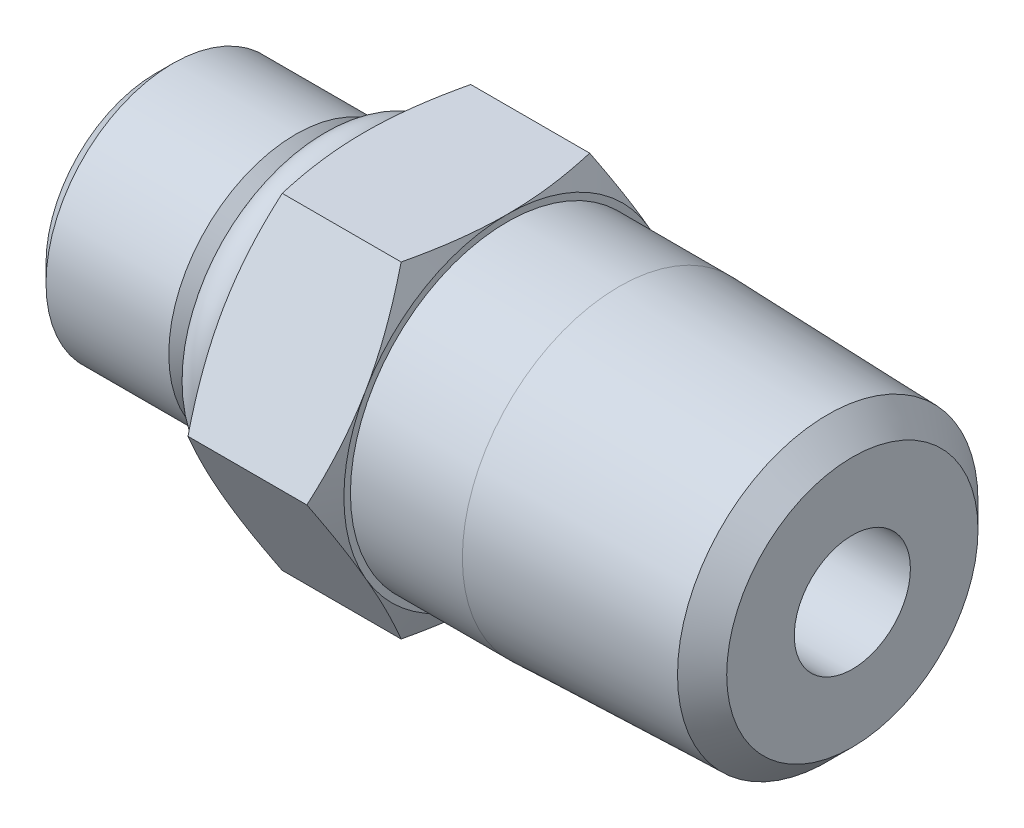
ISO-10303-21;
HEADER;
FILE_DESCRIPTION(('STEP AP214'),'2;1');
FILE_NAME('part.step','',(''),(''),'','','');
FILE_SCHEMA(('AUTOMOTIVE_DESIGN { 1 0 10303 214 1 1 1 1 }'));
ENDSEC;
DATA;
#1=APPLICATION_CONTEXT('core data for automotive mechanical design processes');
#2=APPLICATION_PROTOCOL_DEFINITION('international standard','automotive_design',2000,#1);
#3=PRODUCT_CONTEXT('',#1,'mechanical');
#4=PRODUCT('Part','Part','',(#3));
#5=PRODUCT_RELATED_PRODUCT_CATEGORY('part','',(#4));
#6=PRODUCT_DEFINITION_FORMATION('','',#4);
#7=PRODUCT_DEFINITION_CONTEXT('part definition',#1,'design');
#8=PRODUCT_DEFINITION('design','',#6,#7);
#9=PRODUCT_DEFINITION_SHAPE('','',#8);
#10=(LENGTH_UNIT() NAMED_UNIT(*) SI_UNIT(.MILLI.,.METRE.));
#11=(NAMED_UNIT(*) PLANE_ANGLE_UNIT() SI_UNIT($,.RADIAN.));
#12=(NAMED_UNIT(*) SI_UNIT($,.STERADIAN.) SOLID_ANGLE_UNIT());
#13=UNCERTAINTY_MEASURE_WITH_UNIT(LENGTH_MEASURE(1.E-05),#10,'distance_accuracy_value','');
#14=(GEOMETRIC_REPRESENTATION_CONTEXT(3) GLOBAL_UNCERTAINTY_ASSIGNED_CONTEXT((#13)) GLOBAL_UNIT_ASSIGNED_CONTEXT((#10,
#11,#12)) REPRESENTATION_CONTEXT('',''));
#15=CARTESIAN_POINT('',(0.,0.,0.));
#16=DIRECTION('',(0.,0.,1.));
#17=DIRECTION('',(1.,0.,0.));
#18=AXIS2_PLACEMENT_3D('',#15,#16,#17);
#19=CARTESIAN_POINT('',(8.128,0.,0.));
#20=DIRECTION('',(-1.,0.,0.));
#21=DIRECTION('',(0.,0.,1.));
#22=AXIS2_PLACEMENT_3D('',#19,#20,#21);
#23=TOROIDAL_SURFACE('',#22,5.5753,0.9906);
#24=ADVANCED_FACE('P0_F13',(),#23,.T.);
#25=CLOSED_SHELL('',(#24));
#26=MANIFOLD_SOLID_BREP('P0_B1',#25);
#27=CARTESIAN_POINT('',(9.144,0.,0.));
#28=DIRECTION('',(1.,0.,0.));
#29=DIRECTION('',(0.,0.,-1.));
#30=AXIS2_PLACEMENT_3D('',#27,#28,#29);
#31=CONICAL_SURFACE('',#30,7.14375,1.13446401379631);
#32=CARTESIAN_POINT('',(9.144,-3.571875,6.18666897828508));
#33=CARTESIAN_POINT('',(9.14397935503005,-3.722522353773,6.09969268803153));
#34=CARTESIAN_POINT('',(9.14696231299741,-3.87316545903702,6.01271885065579));
#35=CARTESIAN_POINT('',(9.15878262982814,-4.17426267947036,5.83888028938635));
#36=CARTESIAN_POINT('',(9.16761931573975,-4.32471681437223,5.75201555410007));
#37=CARTESIAN_POINT('',(9.19095547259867,-4.62479040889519,5.57876798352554));
#38=CARTESIAN_POINT('',(9.20543600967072,-4.77441098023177,5.49238450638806));
#39=CARTESIAN_POINT('',(9.2397794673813,-5.07318655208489,5.31988634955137));
#40=CARTESIAN_POINT('',(9.25964246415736,-5.22234154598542,5.23377167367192));
#41=CARTESIAN_POINT('',(9.32676799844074,-5.66870101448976,4.97606591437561));
#42=CARTESIAN_POINT('',(9.38158796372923,-5.96505481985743,4.80496596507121));
#43=CARTESIAN_POINT('',(9.50838008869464,-6.55605482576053,4.46375195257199));
#44=CARTESIAN_POINT('',(9.58040947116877,-6.85069189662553,4.29364316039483));
#45=CARTESIAN_POINT('',(9.65933616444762,-7.14375,4.12444598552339));
#46=B_SPLINE_CURVE_WITH_KNOTS('',3,(#32,#33,#34,#35,#36,#37,#38,#39,#40,#41,#42,#43,#44,#45),
.UNSPECIFIED.,.F.,.F.,(4,2,2,2,2,2,4),(0.,0.521824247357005,1.04358851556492,1.56361724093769,
2.08365332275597,3.12284200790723,4.1655353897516),.UNSPECIFIED.);
#47=CARTESIAN_POINT('',(9.144,-3.571875,6.18666897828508));
#48=VERTEX_POINT('',#47);
#49=CARTESIAN_POINT('',(9.65933616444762,-7.14375,4.12444598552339));
#50=VERTEX_POINT('',#49);
#51=EDGE_CURVE('P1_E223',#48,#50,#46,.T.);
#52=ORIENTED_EDGE('',*,*,#51,.F.);
#53=CARTESIAN_POINT('',(9.144,0.,0.));
#54=DIRECTION('',(1.,0.,0.));
#55=DIRECTION('',(0.,0.,-1.));
#56=AXIS2_PLACEMENT_3D('',#53,#54,#55);
#57=CIRCLE('',#56,7.14375);
#58=CARTESIAN_POINT('',(9.144,-7.14375,0.));
#59=VERTEX_POINT('',#58);
#60=EDGE_CURVE('P1_E229',#48,#59,#57,.T.);
#61=ORIENTED_EDGE('',*,*,#60,.T.);
#62=CARTESIAN_POINT('',(9.65933616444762,-7.14374999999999,4.12444598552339));
#63=CARTESIAN_POINT('',(9.58040947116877,-7.14374999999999,3.78605163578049));
#64=CARTESIAN_POINT('',(9.50838008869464,-7.14374999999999,3.44583405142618));
#65=CARTESIAN_POINT('',(9.38158796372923,-7.14374999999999,2.76340602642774));
#66=CARTESIAN_POINT('',(9.32676799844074,-7.14374999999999,2.42120612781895));
#67=CARTESIAN_POINT('',(9.25964246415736,-7.14374999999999,1.90579460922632));
#68=CARTESIAN_POINT('',(9.2397794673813,-7.14374999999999,1.73356525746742));
#69=CARTESIAN_POINT('',(9.20543600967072,-7.14374999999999,1.38856894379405));
#70=CARTESIAN_POINT('',(9.19095547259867,-7.14375,1.21580198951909));
#71=CARTESIAN_POINT('',(9.16761931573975,-7.14375,0.869306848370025));
#72=CARTESIAN_POINT('',(9.15878262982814,-7.14375,0.695577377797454));
#73=CARTESIAN_POINT('',(9.14696231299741,-7.14375,0.347900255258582));
#74=CARTESIAN_POINT('',(9.14397935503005,-7.14375,0.173952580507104));
#75=CARTESIAN_POINT('',(9.144,-7.14375,0.));
#76=B_SPLINE_CURVE_WITH_KNOTS('',3,(#62,#63,#64,#65,#66,#67,#68,#69,#70,#71,#72,#73,#74,#75),
.UNSPECIFIED.,.F.,.F.,(4,2,2,2,2,2,4),(0.,1.04269338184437,2.08188206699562,2.6019181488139,
3.12194687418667,3.64371114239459,4.16553538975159),.UNSPECIFIED.);
#77=EDGE_CURVE('P1_E115',#50,#59,#76,.T.);
#78=ORIENTED_EDGE('',*,*,#77,.F.);
#79=EDGE_LOOP('',(#52,#61,#78));
#80=FACE_BOUND('',#79,.T.);
#81=ADVANCED_FACE('P1_F16',(#80),#31,.T.);
#82=CARTESIAN_POINT('',(9.144,0.,0.));
#83=DIRECTION('',(1.,0.,0.));
#84=DIRECTION('',(0.,0.,-1.));
#85=AXIS2_PLACEMENT_3D('',#82,#83,#84);
#86=CONICAL_SURFACE('',#85,7.14375,1.13446401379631);
#87=CARTESIAN_POINT('',(9.144,-7.14375,0.));
#88=CARTESIAN_POINT('',(9.14397935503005,-7.14375,-0.1739525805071));
#89=CARTESIAN_POINT('',(9.14696231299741,-7.14375,-0.347900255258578));
#90=CARTESIAN_POINT('',(9.15878262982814,-7.14375,-0.695577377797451));
#91=CARTESIAN_POINT('',(9.16761931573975,-7.14375,-0.869306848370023));
#92=CARTESIAN_POINT('',(9.19095547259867,-7.14375,-1.21580198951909));
#93=CARTESIAN_POINT('',(9.20543600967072,-7.14375,-1.38856894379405));
#94=CARTESIAN_POINT('',(9.2397794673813,-7.14375,-1.73356525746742));
#95=CARTESIAN_POINT('',(9.25964246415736,-7.14375,-1.90579460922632));
#96=CARTESIAN_POINT('',(9.32676799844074,-7.14375,-2.42120612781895));
#97=CARTESIAN_POINT('',(9.38158796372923,-7.14375,-2.76340602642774));
#98=CARTESIAN_POINT('',(9.50838008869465,-7.14375,-3.44583405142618));
#99=CARTESIAN_POINT('',(9.58040947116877,-7.14375,-3.78605163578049));
#100=CARTESIAN_POINT('',(9.65933616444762,-7.14375,-4.12444598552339));
#101=B_SPLINE_CURVE_WITH_KNOTS('',3,(#87,#88,#89,#90,#91,#92,#93,#94,#95,#96,#97,#98,#99,#100),
.UNSPECIFIED.,.F.,.F.,(4,2,2,2,2,2,4),(0.,0.521824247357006,1.04358851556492,1.56361724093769,
2.08365332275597,3.12284200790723,4.1655353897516),.UNSPECIFIED.);
#102=CARTESIAN_POINT('',(9.65933616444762,-7.14375,-4.12444598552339));
#103=VERTEX_POINT('',#102);
#104=EDGE_CURVE('P1_E106',#59,#103,#101,.T.);
#105=ORIENTED_EDGE('',*,*,#104,.F.);
#106=CARTESIAN_POINT('',(9.144,0.,0.));
#107=DIRECTION('',(1.,0.,0.));
#108=DIRECTION('',(0.,0.,-1.));
#109=AXIS2_PLACEMENT_3D('',#106,#107,#108);
#110=CIRCLE('',#109,7.14375);
#111=CARTESIAN_POINT('',(9.144,-3.57187500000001,-6.18666897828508));
#112=VERTEX_POINT('',#111);
#113=EDGE_CURVE('P1_E123',#59,#112,#110,.T.);
#114=ORIENTED_EDGE('',*,*,#113,.T.);
#115=CARTESIAN_POINT('',(9.65933616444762,-7.14375,-4.12444598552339));
#116=CARTESIAN_POINT('',(9.58040947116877,-6.85069189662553,-4.29364316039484));
#117=CARTESIAN_POINT('',(9.50838008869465,-6.55605482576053,-4.46375195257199));
#118=CARTESIAN_POINT('',(9.38158796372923,-5.96505481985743,-4.80496596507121));
#119=CARTESIAN_POINT('',(9.32676799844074,-5.66870101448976,-4.97606591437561));
#120=CARTESIAN_POINT('',(9.25964246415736,-5.22234154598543,-5.23377167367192));
#121=CARTESIAN_POINT('',(9.2397794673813,-5.0731865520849,-5.31988634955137));
#122=CARTESIAN_POINT('',(9.20543600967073,-4.77441098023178,-5.49238450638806));
#123=CARTESIAN_POINT('',(9.19095547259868,-4.6247904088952,-5.57876798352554));
#124=CARTESIAN_POINT('',(9.16761931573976,-4.32471681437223,-5.75201555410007));
#125=CARTESIAN_POINT('',(9.15878262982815,-4.17426267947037,-5.83888028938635));
#126=CARTESIAN_POINT('',(9.14696231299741,-3.87316545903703,-6.01271885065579));
#127=CARTESIAN_POINT('',(9.14397935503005,-3.72252235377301,-6.09969268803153));
#128=CARTESIAN_POINT('',(9.144,-3.57187500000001,-6.18666897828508));
#129=B_SPLINE_CURVE_WITH_KNOTS('',3,(#115,#116,#117,#118,#119,#120,#121,#122,#123,#124,#125,
#126,#127,#128),.UNSPECIFIED.,.F.,.F.,(4,2,2,2,2,2,4),(0.,1.04269338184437,2.08188206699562,
2.6019181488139,3.12194687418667,3.64371114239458,4.16553538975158),.UNSPECIFIED.);
#130=EDGE_CURVE('P1_E20',#103,#112,#129,.T.);
#131=ORIENTED_EDGE('',*,*,#130,.F.);
#132=EDGE_LOOP('',(#105,#114,#131));
#133=FACE_BOUND('',#132,.T.);
#134=ADVANCED_FACE('P1_F121',(#133),#86,.T.);
#135=CARTESIAN_POINT('',(9.144,0.,0.));
#136=DIRECTION('',(1.,0.,0.));
#137=DIRECTION('',(0.,0.,-1.));
#138=AXIS2_PLACEMENT_3D('',#135,#136,#137);
#139=CONICAL_SURFACE('',#138,7.14375,1.13446401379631);
#140=CARTESIAN_POINT('',(9.144,0.,0.));
#141=DIRECTION('',(1.,0.,0.));
#142=DIRECTION('',(0.,0.,-1.));
#143=AXIS2_PLACEMENT_3D('',#140,#141,#142);
#144=CIRCLE('',#143,7.14375);
#145=CARTESIAN_POINT('',(9.144,3.571875,-6.18666897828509));
#146=VERTEX_POINT('',#145);
#147=EDGE_CURVE('P1_E366',#112,#146,#144,.T.);
#148=ORIENTED_EDGE('',*,*,#147,.T.);
#149=CARTESIAN_POINT('',(9.65933616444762,0.,-8.24889197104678));
#150=CARTESIAN_POINT('',(9.58040947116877,0.293058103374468,-8.07969479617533));
#151=CARTESIAN_POINT('',(9.50838008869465,0.587695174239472,-7.90958600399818));
#152=CARTESIAN_POINT('',(9.38158796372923,1.17869518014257,-7.56837199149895));
#153=CARTESIAN_POINT('',(9.32676799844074,1.47504898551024,-7.39727204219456));
#154=CARTESIAN_POINT('',(9.25964246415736,1.92140845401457,-7.13956628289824));
#155=CARTESIAN_POINT('',(9.2397794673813,2.0705634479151,-7.0534516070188));
#156=CARTESIAN_POINT('',(9.20543600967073,2.36933901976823,-6.88095345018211));
#157=CARTESIAN_POINT('',(9.19095547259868,2.51895959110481,-6.79456997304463));
#158=CARTESIAN_POINT('',(9.16761931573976,2.81903318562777,-6.6213224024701));
#159=CARTESIAN_POINT('',(9.15878262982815,2.96948732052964,-6.53445766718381));
#160=CARTESIAN_POINT('',(9.14696231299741,3.27058454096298,-6.36061910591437));
#161=CARTESIAN_POINT('',(9.14397935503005,3.42122764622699,-6.27364526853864));
#162=CARTESIAN_POINT('',(9.144,3.571875,-6.18666897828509));
#163=B_SPLINE_CURVE_WITH_KNOTS('',3,(#149,#150,#151,#152,#153,#154,#155,#156,#157,#158,#159,
#160,#161,#162),.UNSPECIFIED.,.F.,.F.,(4,2,2,2,2,2,4),(0.,1.04269338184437,2.08188206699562,
2.60191814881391,3.12194687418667,3.64371114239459,4.16553538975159),.UNSPECIFIED.);
#164=CARTESIAN_POINT('',(9.65933616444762,0.,-8.24889197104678));
#165=VERTEX_POINT('',#164);
#166=EDGE_CURVE('P1_E150',#165,#146,#163,.T.);
#167=ORIENTED_EDGE('',*,*,#166,.F.);
#168=CARTESIAN_POINT('',(9.144,-3.57187500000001,-6.18666897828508));
#169=CARTESIAN_POINT('',(9.14397935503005,-3.421227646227,-6.27364526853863));
#170=CARTESIAN_POINT('',(9.14696231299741,-3.27058454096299,-6.36061910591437));
#171=CARTESIAN_POINT('',(9.15878262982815,-2.96948732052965,-6.53445766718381));
#172=CARTESIAN_POINT('',(9.16761931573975,-2.81903318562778,-6.62132240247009));
#173=CARTESIAN_POINT('',(9.19095547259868,-2.51895959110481,-6.79456997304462));
#174=CARTESIAN_POINT('',(9.20543600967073,-2.36933901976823,-6.88095345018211));
#175=CARTESIAN_POINT('',(9.2397794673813,-2.07056344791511,-7.05345160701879));
#176=CARTESIAN_POINT('',(9.25964246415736,-1.92140845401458,-7.13956628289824));
#177=CARTESIAN_POINT('',(9.32676799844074,-1.47504898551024,-7.39727204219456));
#178=CARTESIAN_POINT('',(9.38158796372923,-1.17869518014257,-7.56837199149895));
#179=CARTESIAN_POINT('',(9.50838008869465,-0.587695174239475,-7.90958600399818));
#180=CARTESIAN_POINT('',(9.58040947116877,-0.29305810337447,-8.07969479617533));
#181=CARTESIAN_POINT('',(9.65933616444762,0.,-8.24889197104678));
#182=B_SPLINE_CURVE_WITH_KNOTS('',3,(#168,#169,#170,#171,#172,#173,#174,#175,#176,#177,#178,
#179,#180,#181),.UNSPECIFIED.,.F.,.F.,(4,2,2,2,2,2,4),(0.,0.521824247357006,1.04358851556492,
1.56361724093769,2.08365332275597,3.12284200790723,4.1655353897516),.UNSPECIFIED.);
#183=EDGE_CURVE('P1_E126',#112,#165,#182,.T.);
#184=ORIENTED_EDGE('',*,*,#183,.F.);
#185=EDGE_LOOP('',(#148,#167,#184));
#186=FACE_BOUND('',#185,.T.);
#187=ADVANCED_FACE('P1_F350',(#186),#139,.T.);
#188=CARTESIAN_POINT('',(9.144,0.,0.));
#189=DIRECTION('',(1.,0.,0.));
#190=DIRECTION('',(0.,0.,-1.));
#191=AXIS2_PLACEMENT_3D('',#188,#189,#190);
#192=CONICAL_SURFACE('',#191,7.14375,1.13446401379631);
#193=CARTESIAN_POINT('',(9.144,0.,0.));
#194=DIRECTION('',(1.,0.,0.));
#195=DIRECTION('',(0.,0.,-1.));
#196=AXIS2_PLACEMENT_3D('',#193,#194,#195);
#197=CIRCLE('',#196,7.14375);
#198=CARTESIAN_POINT('',(9.144,7.14375,0.));
#199=VERTEX_POINT('',#198);
#200=EDGE_CURVE('P1_E369',#146,#199,#197,.T.);
#201=ORIENTED_EDGE('',*,*,#200,.T.);
#202=CARTESIAN_POINT('',(9.65933616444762,7.14375,-4.12444598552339));
#203=CARTESIAN_POINT('',(9.58040947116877,7.14375,-3.78605163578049));
#204=CARTESIAN_POINT('',(9.50838008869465,7.14375,-3.44583405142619));
#205=CARTESIAN_POINT('',(9.38158796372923,7.14375,-2.76340602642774));
#206=CARTESIAN_POINT('',(9.32676799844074,7.14375,-2.42120612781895));
#207=CARTESIAN_POINT('',(9.25964246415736,7.14375,-1.90579460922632));
#208=CARTESIAN_POINT('',(9.2397794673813,7.14375,-1.73356525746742));
#209=CARTESIAN_POINT('',(9.20543600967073,7.14375,-1.38856894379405));
#210=CARTESIAN_POINT('',(9.19095547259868,7.14375,-1.21580198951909));
#211=CARTESIAN_POINT('',(9.16761931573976,7.14375,-0.869306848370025));
#212=CARTESIAN_POINT('',(9.15878262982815,7.14375,-0.695577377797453));
#213=CARTESIAN_POINT('',(9.14696231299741,7.14375,-0.34790025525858));
#214=CARTESIAN_POINT('',(9.14397935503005,7.14375,-0.173952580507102));
#215=CARTESIAN_POINT('',(9.144,7.14375,0.));
#216=B_SPLINE_CURVE_WITH_KNOTS('',3,(#202,#203,#204,#205,#206,#207,#208,#209,#210,#211,#212,
#213,#214,#215),.UNSPECIFIED.,.F.,.F.,(4,2,2,2,2,2,4),(0.,1.04269338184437,2.08188206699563,
2.60191814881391,3.12194687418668,3.64371114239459,4.1655353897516),.UNSPECIFIED.);
#217=CARTESIAN_POINT('',(9.65933616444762,7.14375,-4.1244459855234));
#218=VERTEX_POINT('',#217);
#219=EDGE_CURVE('P1_E146',#218,#199,#216,.T.);
#220=ORIENTED_EDGE('',*,*,#219,.F.);
#221=CARTESIAN_POINT('',(9.144,3.571875,-6.18666897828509));
#222=CARTESIAN_POINT('',(9.14397935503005,3.72252235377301,-6.09969268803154));
#223=CARTESIAN_POINT('',(9.14696231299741,3.87316545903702,-6.0127188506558));
#224=CARTESIAN_POINT('',(9.15878262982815,4.17426267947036,-5.83888028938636));
#225=CARTESIAN_POINT('',(9.16761931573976,4.32471681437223,-5.75201555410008));
#226=CARTESIAN_POINT('',(9.19095547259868,4.62479040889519,-5.57876798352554));
#227=CARTESIAN_POINT('',(9.20543600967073,4.77441098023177,-5.49238450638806));
#228=CARTESIAN_POINT('',(9.2397794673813,5.0731865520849,-5.31988634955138));
#229=CARTESIAN_POINT('',(9.25964246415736,5.22234154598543,-5.23377167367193));
#230=CARTESIAN_POINT('',(9.32676799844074,5.66870101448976,-4.97606591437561));
#231=CARTESIAN_POINT('',(9.38158796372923,5.96505481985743,-4.80496596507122));
#232=CARTESIAN_POINT('',(9.50838008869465,6.55605482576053,-4.463751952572));
#233=CARTESIAN_POINT('',(9.58040947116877,6.85069189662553,-4.29364316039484));
#234=CARTESIAN_POINT('',(9.65933616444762,7.14375,-4.1244459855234));
#235=B_SPLINE_CURVE_WITH_KNOTS('',3,(#221,#222,#223,#224,#225,#226,#227,#228,#229,#230,#231,
#232,#233,#234),.UNSPECIFIED.,.F.,.F.,(4,2,2,2,2,2,4),(0.,0.521824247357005,1.04358851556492,
1.56361724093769,2.08365332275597,3.12284200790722,4.16553538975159),.UNSPECIFIED.);
#236=EDGE_CURVE('P1_E147',#146,#218,#235,.T.);
#237=ORIENTED_EDGE('',*,*,#236,.F.);
#238=EDGE_LOOP('',(#201,#220,#237));
#239=FACE_BOUND('',#238,.T.);
#240=ADVANCED_FACE('P1_F347',(#239),#192,.T.);
#241=CARTESIAN_POINT('',(9.144,0.,0.));
#242=DIRECTION('',(1.,0.,0.));
#243=DIRECTION('',(0.,0.,-1.));
#244=AXIS2_PLACEMENT_3D('',#241,#242,#243);
#245=CONICAL_SURFACE('',#244,7.14375,1.13446401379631);
#246=CARTESIAN_POINT('',(9.144,0.,0.));
#247=DIRECTION('',(1.,0.,0.));
#248=DIRECTION('',(0.,0.,-1.));
#249=AXIS2_PLACEMENT_3D('',#246,#247,#248);
#250=CIRCLE('',#249,7.14375);
#251=CARTESIAN_POINT('',(9.144,3.571875,6.18666897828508));
#252=VERTEX_POINT('',#251);
#253=EDGE_CURVE('P1_E377',#199,#252,#250,.T.);
#254=ORIENTED_EDGE('',*,*,#253,.T.);
#255=CARTESIAN_POINT('',(9.65933616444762,7.14375,4.12444598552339));
#256=CARTESIAN_POINT('',(9.58040947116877,6.85069189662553,4.29364316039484));
#257=CARTESIAN_POINT('',(9.50838008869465,6.55605482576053,4.46375195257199));
#258=CARTESIAN_POINT('',(9.38158796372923,5.96505481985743,4.80496596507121));
#259=CARTESIAN_POINT('',(9.32676799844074,5.66870101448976,4.97606591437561));
#260=CARTESIAN_POINT('',(9.25964246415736,5.22234154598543,5.23377167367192));
#261=CARTESIAN_POINT('',(9.2397794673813,5.0731865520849,5.31988634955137));
#262=CARTESIAN_POINT('',(9.20543600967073,4.77441098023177,5.49238450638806));
#263=CARTESIAN_POINT('',(9.19095547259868,4.62479040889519,5.57876798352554));
#264=CARTESIAN_POINT('',(9.16761931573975,4.32471681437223,5.75201555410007));
#265=CARTESIAN_POINT('',(9.15878262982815,4.17426267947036,5.83888028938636));
#266=CARTESIAN_POINT('',(9.14696231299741,3.87316545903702,6.01271885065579));
#267=CARTESIAN_POINT('',(9.14397935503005,3.72252235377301,6.09969268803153));
#268=CARTESIAN_POINT('',(9.144,3.571875,6.18666897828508));
#269=B_SPLINE_CURVE_WITH_KNOTS('',3,(#255,#256,#257,#258,#259,#260,#261,#262,#263,#264,#265,
#266,#267,#268),.UNSPECIFIED.,.F.,.F.,(4,2,2,2,2,2,4),(0.,1.04269338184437,2.08188206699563,
2.60191814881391,3.12194687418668,3.64371114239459,4.1655353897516),.UNSPECIFIED.);
#270=CARTESIAN_POINT('',(9.65933616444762,7.14375,4.12444598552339));
#271=VERTEX_POINT('',#270);
#272=EDGE_CURVE('P1_E141',#271,#252,#269,.T.);
#273=ORIENTED_EDGE('',*,*,#272,.F.);
#274=CARTESIAN_POINT('',(9.144,7.14375,0.));
#275=CARTESIAN_POINT('',(9.14397935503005,7.14375,0.1739525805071));
#276=CARTESIAN_POINT('',(9.14696231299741,7.14375,0.347900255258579));
#277=CARTESIAN_POINT('',(9.15878262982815,7.14375,0.695577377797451));
#278=CARTESIAN_POINT('',(9.16761931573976,7.14375,0.869306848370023));
#279=CARTESIAN_POINT('',(9.19095547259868,7.14375,1.21580198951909));
#280=CARTESIAN_POINT('',(9.20543600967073,7.14375,1.38856894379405));
#281=CARTESIAN_POINT('',(9.2397794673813,7.14375,1.73356525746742));
#282=CARTESIAN_POINT('',(9.25964246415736,7.14375,1.90579460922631));
#283=CARTESIAN_POINT('',(9.32676799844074,7.14375,2.42120612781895));
#284=CARTESIAN_POINT('',(9.38158796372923,7.14375,2.76340602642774));
#285=CARTESIAN_POINT('',(9.50838008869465,7.14375,3.44583405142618));
#286=CARTESIAN_POINT('',(9.58040947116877,7.14375,3.78605163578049));
#287=CARTESIAN_POINT('',(9.65933616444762,7.14375,4.12444598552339));
#288=B_SPLINE_CURVE_WITH_KNOTS('',3,(#274,#275,#276,#277,#278,#279,#280,#281,#282,#283,#284,
#285,#286,#287),.UNSPECIFIED.,.F.,.F.,(4,2,2,2,2,2,4),(0.,0.521824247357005,1.04358851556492,
1.56361724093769,2.08365332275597,3.12284200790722,4.16553538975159),.UNSPECIFIED.);
#289=EDGE_CURVE('P1_E142',#199,#271,#288,.T.);
#290=ORIENTED_EDGE('',*,*,#289,.F.);
#291=EDGE_LOOP('',(#254,#273,#290));
#292=FACE_BOUND('',#291,.T.);
#293=ADVANCED_FACE('P1_F243',(#292),#245,.T.);
#294=CARTESIAN_POINT('',(9.144,0.,0.));
#295=DIRECTION('',(1.,0.,0.));
#296=DIRECTION('',(0.,0.,-1.));
#297=AXIS2_PLACEMENT_3D('',#294,#295,#296);
#298=CONICAL_SURFACE('',#297,7.14375,1.13446401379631);
#299=CARTESIAN_POINT('',(9.144,0.,0.));
#300=DIRECTION('',(1.,0.,0.));
#301=DIRECTION('',(0.,0.,-1.));
#302=AXIS2_PLACEMENT_3D('',#299,#300,#301);
#303=CIRCLE('',#302,7.14375);
#304=EDGE_CURVE('P1_E395',#252,#48,#303,.T.);
#305=ORIENTED_EDGE('',*,*,#304,.T.);
#306=CARTESIAN_POINT('',(9.65933616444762,0.,8.24889197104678));
#307=CARTESIAN_POINT('',(9.58040947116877,-0.293058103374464,8.07969479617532));
#308=CARTESIAN_POINT('',(9.50838008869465,-0.587695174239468,7.90958600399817));
#309=CARTESIAN_POINT('',(9.38158796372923,-1.17869518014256,7.56837199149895));
#310=CARTESIAN_POINT('',(9.32676799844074,-1.47504898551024,7.39727204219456));
#311=CARTESIAN_POINT('',(9.25964246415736,-1.92140845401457,7.13956628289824));
#312=CARTESIAN_POINT('',(9.2397794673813,-2.0705634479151,7.05345160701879));
#313=CARTESIAN_POINT('',(9.20543600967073,-2.36933901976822,6.8809534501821));
#314=CARTESIAN_POINT('',(9.19095547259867,-2.51895959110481,6.79456997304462));
#315=CARTESIAN_POINT('',(9.16761931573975,-2.81903318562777,6.62132240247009));
#316=CARTESIAN_POINT('',(9.15878262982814,-2.96948732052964,6.53445766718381));
#317=CARTESIAN_POINT('',(9.14696231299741,-3.27058454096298,6.36061910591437));
#318=CARTESIAN_POINT('',(9.14397935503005,-3.42122764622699,6.27364526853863));
#319=CARTESIAN_POINT('',(9.144,-3.571875,6.18666897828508));
#320=B_SPLINE_CURVE_WITH_KNOTS('',3,(#306,#307,#308,#309,#310,#311,#312,#313,#314,#315,#316,
#317,#318,#319),.UNSPECIFIED.,.F.,.F.,(4,2,2,2,2,2,4),(0.,1.04269338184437,2.08188206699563,
2.60191814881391,3.12194687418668,3.64371114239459,4.1655353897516),.UNSPECIFIED.);
#321=CARTESIAN_POINT('',(9.65933616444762,0.,8.24889197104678));
#322=VERTEX_POINT('',#321);
#323=EDGE_CURVE('P1_E134',#322,#48,#320,.T.);
#324=ORIENTED_EDGE('',*,*,#323,.F.);
#325=CARTESIAN_POINT('',(9.144,3.571875,6.18666897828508));
#326=CARTESIAN_POINT('',(9.14397935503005,3.42122764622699,6.27364526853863));
#327=CARTESIAN_POINT('',(9.14696231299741,3.27058454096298,6.36061910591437));
#328=CARTESIAN_POINT('',(9.15878262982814,2.96948732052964,6.53445766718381));
#329=CARTESIAN_POINT('',(9.16761931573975,2.81903318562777,6.62132240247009));
#330=CARTESIAN_POINT('',(9.19095547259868,2.51895959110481,6.79456997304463));
#331=CARTESIAN_POINT('',(9.20543600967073,2.36933901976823,6.88095345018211));
#332=CARTESIAN_POINT('',(9.2397794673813,2.0705634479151,7.05345160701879));
#333=CARTESIAN_POINT('',(9.25964246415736,1.92140845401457,7.13956628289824));
#334=CARTESIAN_POINT('',(9.32676799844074,1.47504898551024,7.39727204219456));
#335=CARTESIAN_POINT('',(9.38158796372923,1.17869518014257,7.56837199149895));
#336=CARTESIAN_POINT('',(9.50838008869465,0.587695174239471,7.90958600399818));
#337=CARTESIAN_POINT('',(9.58040947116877,0.293058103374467,8.07969479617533));
#338=CARTESIAN_POINT('',(9.65933616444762,0.,8.24889197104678));
#339=B_SPLINE_CURVE_WITH_KNOTS('',3,(#325,#326,#327,#328,#329,#330,#331,#332,#333,#334,#335,
#336,#337,#338),.UNSPECIFIED.,.F.,.F.,(4,2,2,2,2,2,4),(0.,0.521824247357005,1.04358851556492,
1.56361724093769,2.08365332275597,3.12284200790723,4.16553538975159),.UNSPECIFIED.);
#340=EDGE_CURVE('P1_E251',#252,#322,#339,.T.);
#341=ORIENTED_EDGE('',*,*,#340,.F.);
#342=EDGE_LOOP('',(#305,#324,#341));
#343=FACE_BOUND('',#342,.T.);
#344=ADVANCED_FACE('P1_F239',(#343),#298,.T.);
#345=CARTESIAN_POINT('',(9.144,0.,-8.24889197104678));
#346=DIRECTION('',(0.,-0.500000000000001,-0.866025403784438));
#347=DIRECTION('',(0.,0.866025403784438,-0.500000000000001));
#348=AXIS2_PLACEMENT_3D('',#345,#346,#347);
#349=PLANE('',#348);
#350=ORIENTED_EDGE('',*,*,#183,.T.);
#351=DIRECTION('',(1.,0.,0.));
#352=VECTOR('',#351,1.);
#353=CARTESIAN_POINT('',(9.144,0.,-8.24889197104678));
#354=LINE('',#353,#352);
#355=CARTESIAN_POINT('',(14.861823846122,-3.92596372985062E-08,-8.24889194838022));
#356=VERTEX_POINT('',#355);
#357=EDGE_CURVE('P1_E148',#356,#165,#354,.F.);
#358=ORIENTED_EDGE('',*,*,#357,.F.);
#359=CARTESIAN_POINT('',(14.8618238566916,-7.85192770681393E-08,-8.24889192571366));
#360=CARTESIAN_POINT('',(14.9407505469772,-0.293058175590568,-8.07969475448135));
#361=CARTESIAN_POINT('',(15.0127799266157,-0.587695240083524,-7.9095859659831));
#362=CARTESIAN_POINT('',(15.1395720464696,-1.17869523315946,-7.56837196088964));
#363=CARTESIAN_POINT('',(15.1943920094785,-1.47504903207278,-7.39727201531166));
#364=CARTESIAN_POINT('',(15.2615175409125,-1.92140849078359,-7.13956626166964));
#365=CARTESIAN_POINT('',(15.2813805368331,-2.07056348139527,-7.05345158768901));
#366=CARTESIAN_POINT('',(15.3157239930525,-2.36933904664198,-6.88095343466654));
#367=CARTESIAN_POINT('',(15.3302045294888,-2.51895961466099,-6.79456995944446));
#368=CARTESIAN_POINT('',(15.3535406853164,-2.81903320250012,-6.62132239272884));
#369=CARTESIAN_POINT('',(15.3623773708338,-2.96948733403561,-6.53445765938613));
#370=CARTESIAN_POINT('',(15.3741976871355,-3.27058454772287,-6.36061910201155));
#371=CARTESIAN_POINT('',(15.3771806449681,-3.42122764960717,-6.27364526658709));
#372=CARTESIAN_POINT('',(15.37716,-3.571875,-6.18666897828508));
#373=B_SPLINE_CURVE_WITH_KNOTS('',3,(#359,#360,#361,#362,#363,#364,#365,#366,#367,#368,#369,
#370,#371,#372),.UNSPECIFIED.,.F.,.F.,(4,2,2,2,2,2,4),(0.,1.04269335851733,2.0818820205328,
2.60191809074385,3.12194680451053,3.64371106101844,4.16553529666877),.UNSPECIFIED.);
#374=CARTESIAN_POINT('',(15.37716,-3.571875,-6.18666897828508));
#375=VERTEX_POINT('',#374);
#376=EDGE_CURVE('P1_E322',#356,#375,#373,.T.);
#377=ORIENTED_EDGE('',*,*,#376,.T.);
#378=CARTESIAN_POINT('',(15.37716,-3.571875,-6.18666897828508));
#379=CARTESIAN_POINT('',(15.3771806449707,-3.72252235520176,-6.09969268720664));
#380=CARTESIAN_POINT('',(15.3741976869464,-3.87316546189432,-6.01271884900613));
#381=CARTESIAN_POINT('',(15.3623773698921,-4.17426268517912,-5.8388802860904));
#382=CARTESIAN_POINT('',(15.3535406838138,-4.3247168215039,-5.7520155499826));
#383=CARTESIAN_POINT('',(15.330204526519,-4.62479041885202,-5.57876797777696));
#384=CARTESIAN_POINT('',(15.3157239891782,-4.77441099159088,-5.49238449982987));
#385=CARTESIAN_POINT('',(15.2813805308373,-5.07318656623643,-5.31988634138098));
#386=CARTESIAN_POINT('',(15.2615175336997,-5.2223415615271,-5.23377166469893));
#387=CARTESIAN_POINT('',(15.1943919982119,-5.66870103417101,-4.97606590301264));
#388=CARTESIAN_POINT('',(15.1395720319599,-5.96505484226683,-4.80496595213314));
#389=CARTESIAN_POINT('',(15.0127799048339,-6.55605485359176,-4.46375193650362));
#390=CARTESIAN_POINT('',(14.9407505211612,-6.85069192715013,-4.29364314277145));
#391=CARTESIAN_POINT('',(14.8618238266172,-7.14375003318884,-4.1244459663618));
#392=B_SPLINE_CURVE_WITH_KNOTS('',3,(#378,#379,#380,#381,#382,#383,#384,#385,#386,#387,#388,
#389,#390,#391),.UNSPECIFIED.,.F.,.F.,(4,2,2,2,2,2,4),(0.,0.52182425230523,1.04358852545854,
1.56361725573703,2.0836533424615,3.12284203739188,4.16553542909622),.UNSPECIFIED.);
#393=CARTESIAN_POINT('',(14.8618238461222,-7.14375,-4.12444594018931));
#394=VERTEX_POINT('',#393);
#395=EDGE_CURVE('P1_E130',#375,#394,#392,.T.);
#396=ORIENTED_EDGE('',*,*,#395,.T.);
#397=DIRECTION('',(1.,0.,0.));
#398=VECTOR('',#397,1.);
#399=CARTESIAN_POINT('',(9.144,-7.14375,-4.12444598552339));
#400=LINE('',#399,#398);
#401=EDGE_CURVE('P1_E111',#103,#394,#400,.T.);
#402=ORIENTED_EDGE('',*,*,#401,.F.);
#403=ORIENTED_EDGE('',*,*,#130,.T.);
#404=EDGE_LOOP('',(#350,#358,#377,#396,#402,#403));
#405=FACE_BOUND('',#404,.T.);
#406=ADVANCED_FACE('P1_F128',(#405),#349,.T.);
#407=CARTESIAN_POINT('',(9.144,7.14375,-4.1244459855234));
#408=DIRECTION('',(0.,0.5,-0.866025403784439));
#409=DIRECTION('',(0.,0.866025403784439,0.5));
#410=AXIS2_PLACEMENT_3D('',#407,#408,#409);
#411=PLANE('',#410);
#412=ORIENTED_EDGE('',*,*,#236,.T.);
#413=DIRECTION('',(1.,0.,0.));
#414=VECTOR('',#413,1.);
#415=CARTESIAN_POINT('',(9.144,7.14375,-4.1244459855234));
#416=LINE('',#415,#414);
#417=CARTESIAN_POINT('',(14.8618238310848,7.14375001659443,-4.1244459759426));
#418=VERTEX_POINT('',#417);
#419=EDGE_CURVE('P1_E143',#418,#218,#416,.F.);
#420=ORIENTED_EDGE('',*,*,#419,.F.);
#421=CARTESIAN_POINT('',(14.8618238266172,7.14375003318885,-4.1244459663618));
#422=CARTESIAN_POINT('',(14.9407505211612,6.85069192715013,-4.29364314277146));
#423=CARTESIAN_POINT('',(15.0127799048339,6.55605485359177,-4.46375193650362));
#424=CARTESIAN_POINT('',(15.1395720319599,5.96505484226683,-4.80496595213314));
#425=CARTESIAN_POINT('',(15.1943919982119,5.66870103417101,-4.97606590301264));
#426=CARTESIAN_POINT('',(15.2615175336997,5.22234156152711,-5.23377166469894));
#427=CARTESIAN_POINT('',(15.2813805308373,5.07318656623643,-5.31988634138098));
#428=CARTESIAN_POINT('',(15.3157239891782,4.77441099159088,-5.49238449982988));
#429=CARTESIAN_POINT('',(15.330204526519,4.62479041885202,-5.57876797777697));
#430=CARTESIAN_POINT('',(15.3535406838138,4.3247168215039,-5.7520155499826));
#431=CARTESIAN_POINT('',(15.3623773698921,4.17426268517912,-5.83888028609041));
#432=CARTESIAN_POINT('',(15.3741976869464,3.87316546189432,-6.01271884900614));
#433=CARTESIAN_POINT('',(15.3771806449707,3.72252235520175,-6.09969268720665));
#434=CARTESIAN_POINT('',(15.37716,3.571875,-6.18666897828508));
#435=B_SPLINE_CURVE_WITH_KNOTS('',3,(#421,#422,#423,#424,#425,#426,#427,#428,#429,#430,#431,
#432,#433,#434),.UNSPECIFIED.,.F.,.F.,(4,2,2,2,2,2,4),(0.,1.04269339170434,2.08188208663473,
2.6019181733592,3.12194690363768,3.643711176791,4.16553542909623),.UNSPECIFIED.);
#436=CARTESIAN_POINT('',(15.37716,3.571875,-6.18666897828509));
#437=VERTEX_POINT('',#436);
#438=EDGE_CURVE('P1_E286',#418,#437,#435,.T.);
#439=ORIENTED_EDGE('',*,*,#438,.T.);
#440=CARTESIAN_POINT('',(15.37716,3.571875,-6.18666897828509));
#441=CARTESIAN_POINT('',(15.3771806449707,3.42122764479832,-6.27364526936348));
#442=CARTESIAN_POINT('',(15.3741976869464,3.27058453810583,-6.36061910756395));
#443=CARTESIAN_POINT('',(15.3623773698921,2.96948731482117,-6.5344576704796));
#444=CARTESIAN_POINT('',(15.3535406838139,2.81903317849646,-6.62132240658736));
#445=CARTESIAN_POINT('',(15.330204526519,2.51895958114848,-6.79456997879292));
#446=CARTESIAN_POINT('',(15.3157239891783,2.36933900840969,-6.88095345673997));
#447=CARTESIAN_POINT('',(15.2813805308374,2.07056343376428,-7.05345161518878));
#448=CARTESIAN_POINT('',(15.2615175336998,1.92140843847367,-7.13956629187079));
#449=CARTESIAN_POINT('',(15.1943919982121,1.47504896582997,-7.39727205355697));
#450=CARTESIAN_POINT('',(15.1395720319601,1.17869515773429,-7.56837200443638));
#451=CARTESIAN_POINT('',(15.0127799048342,0.587695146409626,-7.90958602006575));
#452=CARTESIAN_POINT('',(14.9407505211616,0.293058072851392,-8.07969481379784));
#453=CARTESIAN_POINT('',(14.8618238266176,-3.31871912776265E-08,-8.24889199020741));
#454=B_SPLINE_CURVE_WITH_KNOTS('',3,(#440,#441,#442,#443,#444,#445,#446,#447,#448,#449,#450,
#451,#452,#453),.UNSPECIFIED.,.F.,.F.,(4,2,2,2,2,2,4),(0.,0.521824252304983,1.04358852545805,
1.56361725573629,2.08365334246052,3.12284203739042,4.16553542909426),.UNSPECIFIED.);
#455=EDGE_CURVE('P1_E316',#437,#356,#454,.T.);
#456=ORIENTED_EDGE('',*,*,#455,.T.);
#457=ORIENTED_EDGE('',*,*,#357,.T.);
#458=ORIENTED_EDGE('',*,*,#166,.T.);
#459=EDGE_LOOP('',(#412,#420,#439,#456,#457,#458));
#460=FACE_BOUND('',#459,.T.);
#461=ADVANCED_FACE('P1_F327',(#460),#411,.T.);
#462=CARTESIAN_POINT('',(9.144,7.14375,0.));
#463=DIRECTION('',(0.,1.,0.));
#464=DIRECTION('',(0.,0.,1.));
#465=AXIS2_PLACEMENT_3D('',#462,#463,#464);
#466=PLANE('',#465);
#467=DIRECTION('',(1.,0.,0.));
#468=VECTOR('',#467,1.);
#469=CARTESIAN_POINT('',(9.144,7.14375,4.12444598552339));
#470=LINE('',#469,#468);
#471=CARTESIAN_POINT('',(14.8618238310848,7.14375,4.12444600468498));
#472=VERTEX_POINT('',#471);
#473=EDGE_CURVE('P1_E138',#472,#271,#470,.F.);
#474=ORIENTED_EDGE('',*,*,#473,.F.);
#475=CARTESIAN_POINT('',(14.8618238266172,7.14375,4.12444602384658));
#476=CARTESIAN_POINT('',(14.9407505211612,7.14375,3.78605167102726));
#477=CARTESIAN_POINT('',(15.0127799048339,7.14375,3.44583408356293));
#478=CARTESIAN_POINT('',(15.1395720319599,7.14375,2.76340605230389));
#479=CARTESIAN_POINT('',(15.1943919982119,7.14375,2.4212061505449));
#480=CARTESIAN_POINT('',(15.2615175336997,7.14375,1.9057946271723));
#481=CARTESIAN_POINT('',(15.2813805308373,7.14375,1.73356527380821));
#482=CARTESIAN_POINT('',(15.3157239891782,7.14375,1.38856895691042));
#483=CARTESIAN_POINT('',(15.330204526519,7.14375,1.21580200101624));
#484=CARTESIAN_POINT('',(15.3535406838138,7.14375,0.86930685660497));
#485=CARTESIAN_POINT('',(15.3623773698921,7.14375,0.695577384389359));
#486=CARTESIAN_POINT('',(15.3741976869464,7.14375,0.347900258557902));
#487=CARTESIAN_POINT('',(15.3771806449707,7.14375,0.173952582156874));
#488=CARTESIAN_POINT('',(15.37716,7.14375,0.));
#489=B_SPLINE_CURVE_WITH_KNOTS('',3,(#475,#476,#477,#478,#479,#480,#481,#482,#483,#484,#485,
#486,#487,#488),.UNSPECIFIED.,.F.,.F.,(4,2,2,2,2,2,4),(0.,1.04269339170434,2.08188208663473,
2.6019181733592,3.12194690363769,3.643711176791,4.16553542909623),.UNSPECIFIED.);
#490=CARTESIAN_POINT('',(15.37716,7.14375,0.));
#491=VERTEX_POINT('',#490);
#492=EDGE_CURVE('P1_E285',#472,#491,#489,.T.);
#493=ORIENTED_EDGE('',*,*,#492,.T.);
#494=CARTESIAN_POINT('',(15.37716,7.14375,0.));
#495=CARTESIAN_POINT('',(15.3771806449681,7.14375,-0.173952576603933));
#496=CARTESIAN_POINT('',(15.3741976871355,7.14375,-0.34790024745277));
#497=CARTESIAN_POINT('',(15.3623773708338,7.14375,-0.695577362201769));
#498=CARTESIAN_POINT('',(15.3535406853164,7.14375,-0.869306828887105));
#499=CARTESIAN_POINT('',(15.3302045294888,7.14375,-1.21580196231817));
#500=CARTESIAN_POINT('',(15.3157239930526,7.14375,-1.38856891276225));
#501=CARTESIAN_POINT('',(15.2813805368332,7.14375,-1.73356521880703));
#502=CARTESIAN_POINT('',(15.2615175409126,7.14375,-1.90579456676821));
#503=CARTESIAN_POINT('',(15.1943920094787,7.14375,-2.42120607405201));
#504=CARTESIAN_POINT('',(15.1395720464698,7.14375,-2.7634059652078));
#505=CARTESIAN_POINT('',(15.012779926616,7.14375,-3.4458339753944));
#506=CARTESIAN_POINT('',(14.9407505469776,7.14375,-3.78605155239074));
#507=CARTESIAN_POINT('',(14.861823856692,7.14375,-4.12444589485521));
#508=B_SPLINE_CURVE_WITH_KNOTS('',3,(#494,#495,#496,#497,#498,#499,#500,#501,#502,#503,#504,
#505,#506,#507),.UNSPECIFIED.,.F.,.F.,(4,2,2,2,2,2,4),(0.,0.521824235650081,1.04358849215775,
1.56361720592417,2.08365327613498,3.12284193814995,4.16553529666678),.UNSPECIFIED.);
#509=EDGE_CURVE('P1_E310',#491,#418,#508,.T.);
#510=ORIENTED_EDGE('',*,*,#509,.T.);
#511=ORIENTED_EDGE('',*,*,#419,.T.);
#512=ORIENTED_EDGE('',*,*,#219,.T.);
#513=ORIENTED_EDGE('',*,*,#289,.T.);
#514=EDGE_LOOP('',(#474,#493,#510,#511,#512,#513));
#515=FACE_BOUND('',#514,.T.);
#516=ADVANCED_FACE('P1_F267',(#515),#466,.T.);
#517=CARTESIAN_POINT('',(9.144,0.,8.24889197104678));
#518=DIRECTION('',(0.,0.5,0.866025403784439));
#519=DIRECTION('',(0.,-0.866025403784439,0.5));
#520=AXIS2_PLACEMENT_3D('',#517,#518,#519);
#521=PLANE('',#520);
#522=DIRECTION('',(1.,0.,0.));
#523=VECTOR('',#522,1.);
#524=CARTESIAN_POINT('',(9.144,0.,8.24889197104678));
#525=LINE('',#524,#523);
#526=CARTESIAN_POINT('',(14.8618238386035,1.13330281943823E-08,8.24889196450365));
#527=VERTEX_POINT('',#526);
#528=EDGE_CURVE('P1_E131',#527,#322,#525,.F.);
#529=ORIENTED_EDGE('',*,*,#528,.F.);
#530=CARTESIAN_POINT('',(14.8618238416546,2.2666052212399E-08,8.24889195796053));
#531=CARTESIAN_POINT('',(14.9407505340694,0.293058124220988,8.07969478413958));
#532=CARTESIAN_POINT('',(15.012779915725,0.587695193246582,7.90958599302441));
#533=CARTESIAN_POINT('',(15.1395720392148,1.17869519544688,7.568371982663));
#534=CARTESIAN_POINT('',(15.1943920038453,1.47504899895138,7.39727203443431));
#535=CARTESIAN_POINT('',(15.2615175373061,1.92140846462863,7.13956627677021));
#536=CARTESIAN_POINT('',(15.2813805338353,2.07056345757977,7.05345160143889));
#537=CARTESIAN_POINT('',(15.3157239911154,2.36933902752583,6.88095344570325));
#538=CARTESIAN_POINT('',(15.3302045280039,2.51895959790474,6.79456996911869));
#539=CARTESIAN_POINT('',(15.3535406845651,2.81903319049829,6.6213223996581));
#540=CARTESIAN_POINT('',(15.3623773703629,2.96948732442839,6.53445766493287));
#541=CARTESIAN_POINT('',(15.374197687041,3.27058454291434,6.36061910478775));
#542=CARTESIAN_POINT('',(15.3771806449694,3.42122764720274,6.27364526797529));
#543=CARTESIAN_POINT('',(15.37716,3.571875,6.18666897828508));
#544=B_SPLINE_CURVE_WITH_KNOTS('',3,(#530,#531,#532,#533,#534,#535,#536,#537,#538,#539,#540,
#541,#542,#543),.UNSPECIFIED.,.F.,.F.,(4,2,2,2,2,2,4),(0.,1.04269337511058,2.08188205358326,
2.6019181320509,3.12194685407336,3.64371111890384,4.1655353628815),.UNSPECIFIED.);
#545=CARTESIAN_POINT('',(15.37716,3.571875,6.18666897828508));
#546=VERTEX_POINT('',#545);
#547=EDGE_CURVE('P1_E272',#527,#546,#544,.T.);
#548=ORIENTED_EDGE('',*,*,#547,.T.);
#549=CARTESIAN_POINT('',(15.37716,3.571875,6.18666897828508));
#550=CARTESIAN_POINT('',(15.3771806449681,3.72252235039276,6.09969268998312));
#551=CARTESIAN_POINT('',(15.3741976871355,3.87316545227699,6.0127188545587));
#552=CARTESIAN_POINT('',(15.3623773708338,4.1742626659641,5.8388802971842));
#553=CARTESIAN_POINT('',(15.3535406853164,4.32471679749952,5.75201556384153));
#554=CARTESIAN_POINT('',(15.3302045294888,4.62479038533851,5.578767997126));
#555=CARTESIAN_POINT('',(15.3157239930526,4.77441095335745,5.49238452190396));
#556=CARTESIAN_POINT('',(15.2813805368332,5.07318651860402,5.31988636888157));
#557=CARTESIAN_POINT('',(15.2615175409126,5.22234150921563,5.23377169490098));
#558=CARTESIAN_POINT('',(15.1943920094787,5.66870096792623,4.97606594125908));
#559=CARTESIAN_POINT('',(15.1395720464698,5.9650547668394,4.80496599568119));
#560=CARTESIAN_POINT('',(15.012779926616,6.55605475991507,4.46375199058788));
#561=CARTESIAN_POINT('',(14.9407505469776,6.85069182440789,4.29364320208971));
#562=CARTESIAN_POINT('',(14.861823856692,7.14374992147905,4.12444603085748));
#563=B_SPLINE_CURVE_WITH_KNOTS('',3,(#549,#550,#551,#552,#553,#554,#555,#556,#557,#558,#559,
#560,#561,#562),.UNSPECIFIED.,.F.,.F.,(4,2,2,2,2,2,4),(0.,0.521824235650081,1.04358849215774,
1.56361720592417,2.08365327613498,3.12284193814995,4.16553529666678),.UNSPECIFIED.);
#564=EDGE_CURVE('P1_E278',#546,#472,#563,.T.);
#565=ORIENTED_EDGE('',*,*,#564,.T.);
#566=ORIENTED_EDGE('',*,*,#473,.T.);
#567=ORIENTED_EDGE('',*,*,#272,.T.);
#568=ORIENTED_EDGE('',*,*,#340,.T.);
#569=EDGE_LOOP('',(#529,#548,#565,#566,#567,#568));
#570=FACE_BOUND('',#569,.T.);
#571=ADVANCED_FACE('P1_F263',(#570),#521,.T.);
#572=CARTESIAN_POINT('',(9.144,-7.14375,-4.12444598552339));
#573=DIRECTION('',(0.,-1.,0.));
#574=DIRECTION('',(0.,0.,-1.));
#575=AXIS2_PLACEMENT_3D('',#572,#573,#574);
#576=PLANE('',#575);
#577=ORIENTED_EDGE('',*,*,#104,.T.);
#578=ORIENTED_EDGE('',*,*,#401,.T.);
#579=CARTESIAN_POINT('',(14.861823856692,-7.14375,-4.12444589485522));
#580=CARTESIAN_POINT('',(14.9407505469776,-7.14375,-3.78605155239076));
#581=CARTESIAN_POINT('',(15.012779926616,-7.14375,-3.44583397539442));
#582=CARTESIAN_POINT('',(15.1395720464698,-7.14375,-2.76340596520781));
#583=CARTESIAN_POINT('',(15.1943920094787,-7.14375,-2.42120607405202));
#584=CARTESIAN_POINT('',(15.2615175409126,-7.14375,-1.90579456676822));
#585=CARTESIAN_POINT('',(15.2813805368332,-7.14375,-1.73356521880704));
#586=CARTESIAN_POINT('',(15.3157239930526,-7.14375,-1.38856891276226));
#587=CARTESIAN_POINT('',(15.3302045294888,-7.14375,-1.21580196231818));
#588=CARTESIAN_POINT('',(15.3535406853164,-7.14375,-0.86930682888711));
#589=CARTESIAN_POINT('',(15.3623773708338,-7.14375,-0.695577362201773));
#590=CARTESIAN_POINT('',(15.3741976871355,-7.14375,-0.347900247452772));
#591=CARTESIAN_POINT('',(15.3771806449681,-7.14375,-0.173952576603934));
#592=CARTESIAN_POINT('',(15.37716,-7.14375,0.));
#593=B_SPLINE_CURVE_WITH_KNOTS('',3,(#579,#580,#581,#582,#583,#584,#585,#586,#587,#588,#589,
#590,#591,#592),.UNSPECIFIED.,.F.,.F.,(4,2,2,2,2,2,4),(0.,1.04269335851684,2.08188202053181,
2.60191809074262,3.12194680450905,3.64371106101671,4.1655352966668),.UNSPECIFIED.);
#594=CARTESIAN_POINT('',(15.37716,-7.14375,0.));
#595=VERTEX_POINT('',#594);
#596=EDGE_CURVE('P1_E394',#394,#595,#593,.T.);
#597=ORIENTED_EDGE('',*,*,#596,.T.);
#598=CARTESIAN_POINT('',(15.37716,-7.14375,0.));
#599=CARTESIAN_POINT('',(15.3771806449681,-7.14375,0.173952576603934));
#600=CARTESIAN_POINT('',(15.3741976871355,-7.14375,0.347900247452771));
#601=CARTESIAN_POINT('',(15.3623773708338,-7.14375,0.69557736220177));
#602=CARTESIAN_POINT('',(15.3535406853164,-7.14375,0.869306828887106));
#603=CARTESIAN_POINT('',(15.3302045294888,-7.14375,1.21580196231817));
#604=CARTESIAN_POINT('',(15.3157239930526,-7.14374999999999,1.38856891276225));
#605=CARTESIAN_POINT('',(15.2813805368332,-7.14374999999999,1.73356521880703));
#606=CARTESIAN_POINT('',(15.2615175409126,-7.14374999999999,1.90579456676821));
#607=CARTESIAN_POINT('',(15.1943920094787,-7.14374999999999,2.42120607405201));
#608=CARTESIAN_POINT('',(15.1395720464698,-7.14374999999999,2.76340596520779));
#609=CARTESIAN_POINT('',(15.012779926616,-7.14374999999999,3.4458339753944));
#610=CARTESIAN_POINT('',(14.9407505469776,-7.14374999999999,3.78605155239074));
#611=CARTESIAN_POINT('',(14.861823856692,-7.14374999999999,4.1244458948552));
#612=B_SPLINE_CURVE_WITH_KNOTS('',3,(#598,#599,#600,#601,#602,#603,#604,#605,#606,#607,#608,
#609,#610,#611),.UNSPECIFIED.,.F.,.F.,(4,2,2,2,2,2,4),(0.,0.521824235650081,1.04358849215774,
1.56361720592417,2.08365327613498,3.12284193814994,4.16553529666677),.UNSPECIFIED.);
#613=CARTESIAN_POINT('',(14.8618238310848,-7.14375001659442,4.12444597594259));
#614=VERTEX_POINT('',#613);
#615=EDGE_CURVE('P1_E194',#595,#614,#612,.T.);
#616=ORIENTED_EDGE('',*,*,#615,.T.);
#617=DIRECTION('',(1.,0.,0.));
#618=VECTOR('',#617,1.);
#619=CARTESIAN_POINT('',(9.144,-7.14374999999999,4.12444598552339));
#620=LINE('',#619,#618);
#621=EDGE_CURVE('P1_E228',#50,#614,#620,.T.);
#622=ORIENTED_EDGE('',*,*,#621,.F.);
#623=ORIENTED_EDGE('',*,*,#77,.T.);
#624=EDGE_LOOP('',(#577,#578,#597,#616,#622,#623));
#625=FACE_BOUND('',#624,.T.);
#626=ADVANCED_FACE('P1_F108',(#625),#576,.T.);
#627=CARTESIAN_POINT('',(9.144,-7.14375,4.12444598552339));
#628=DIRECTION('',(0.,-0.5,0.866025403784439));
#629=DIRECTION('',(0.,-0.866025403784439,-0.5));
#630=AXIS2_PLACEMENT_3D('',#627,#628,#629);
#631=PLANE('',#630);
#632=ORIENTED_EDGE('',*,*,#621,.T.);
#633=CARTESIAN_POINT('',(14.8618238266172,-7.14375003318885,4.12444596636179));
#634=CARTESIAN_POINT('',(14.9407505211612,-6.85069192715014,4.29364314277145));
#635=CARTESIAN_POINT('',(15.0127799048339,-6.55605485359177,4.46375193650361));
#636=CARTESIAN_POINT('',(15.1395720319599,-5.96505484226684,4.80496595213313));
#637=CARTESIAN_POINT('',(15.1943919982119,-5.66870103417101,4.97606590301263));
#638=CARTESIAN_POINT('',(15.2615175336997,-5.22234156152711,5.23377166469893));
#639=CARTESIAN_POINT('',(15.2813805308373,-5.07318656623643,5.31988634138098));
#640=CARTESIAN_POINT('',(15.3157239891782,-4.77441099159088,5.49238449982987));
#641=CARTESIAN_POINT('',(15.330204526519,-4.62479041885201,5.57876797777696));
#642=CARTESIAN_POINT('',(15.3535406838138,-4.3247168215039,5.7520155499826));
#643=CARTESIAN_POINT('',(15.3623773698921,-4.17426268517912,5.8388802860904));
#644=CARTESIAN_POINT('',(15.3741976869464,-3.87316546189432,6.01271884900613));
#645=CARTESIAN_POINT('',(15.3771806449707,-3.72252235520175,6.09969268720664));
#646=CARTESIAN_POINT('',(15.37716,-3.571875,6.18666897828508));
#647=B_SPLINE_CURVE_WITH_KNOTS('',3,(#633,#634,#635,#636,#637,#638,#639,#640,#641,#642,#643,
#644,#645,#646),.UNSPECIFIED.,.F.,.F.,(4,2,2,2,2,2,4),(0.,1.04269339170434,2.08188208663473,
2.6019181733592,3.12194690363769,3.643711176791,4.16553542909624),.UNSPECIFIED.);
#648=CARTESIAN_POINT('',(15.37716,-3.571875,6.18666897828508));
#649=VERTEX_POINT('',#648);
#650=EDGE_CURVE('P1_E186',#614,#649,#647,.T.);
#651=ORIENTED_EDGE('',*,*,#650,.T.);
#652=CARTESIAN_POINT('',(15.37716,-3.571875,6.18666897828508));
#653=CARTESIAN_POINT('',(15.3771806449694,-3.42122764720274,6.27364526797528));
#654=CARTESIAN_POINT('',(15.374197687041,-3.27058454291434,6.36061910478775));
#655=CARTESIAN_POINT('',(15.3623773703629,-2.96948732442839,6.53445766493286));
#656=CARTESIAN_POINT('',(15.3535406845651,-2.81903319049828,6.6213223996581));
#657=CARTESIAN_POINT('',(15.3302045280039,-2.51895959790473,6.79456996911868));
#658=CARTESIAN_POINT('',(15.3157239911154,-2.36933902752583,6.88095344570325));
#659=CARTESIAN_POINT('',(15.2813805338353,-2.07056345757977,7.05345160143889));
#660=CARTESIAN_POINT('',(15.2615175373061,-1.92140846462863,7.13956627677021));
#661=CARTESIAN_POINT('',(15.1943920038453,-1.47504899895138,7.39727203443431));
#662=CARTESIAN_POINT('',(15.1395720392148,-1.17869519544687,7.568371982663));
#663=CARTESIAN_POINT('',(15.012779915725,-0.587695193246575,7.90958599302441));
#664=CARTESIAN_POINT('',(14.9407505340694,-0.293058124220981,8.07969478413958));
#665=CARTESIAN_POINT('',(14.8618238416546,-2.26660443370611E-08,8.24889195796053));
#666=B_SPLINE_CURVE_WITH_KNOTS('',3,(#652,#653,#654,#655,#656,#657,#658,#659,#660,#661,#662,
#663,#664,#665),.UNSPECIFIED.,.F.,.F.,(4,2,2,2,2,2,4),(0.,0.521824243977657,1.04358850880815,
1.5636172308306,2.08365330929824,3.12284198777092,4.16553536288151),.UNSPECIFIED.);
#667=EDGE_CURVE('P1_E39',#649,#527,#666,.T.);
#668=ORIENTED_EDGE('',*,*,#667,.T.);
#669=ORIENTED_EDGE('',*,*,#528,.T.);
#670=ORIENTED_EDGE('',*,*,#323,.T.);
#671=ORIENTED_EDGE('',*,*,#51,.T.);
#672=EDGE_LOOP('',(#632,#651,#668,#669,#670,#671));
#673=FACE_BOUND('',#672,.T.);
#674=ADVANCED_FACE('P1_F204',(#673),#631,.T.);
#675=CARTESIAN_POINT('',(9.144,0.,0.));
#676=DIRECTION('',(1.,0.,0.));
#677=DIRECTION('',(0.,1.,0.));
#678=AXIS2_PLACEMENT_3D('',#675,#676,#677);
#679=PLANE('',#678);
#680=ORIENTED_EDGE('',*,*,#253,.F.);
#681=ORIENTED_EDGE('',*,*,#200,.F.);
#682=ORIENTED_EDGE('',*,*,#147,.F.);
#683=ORIENTED_EDGE('',*,*,#113,.F.);
#684=ORIENTED_EDGE('',*,*,#60,.F.);
#685=ORIENTED_EDGE('',*,*,#304,.F.);
#686=EDGE_LOOP('',(#680,#681,#682,#683,#684,#685));
#687=FACE_BOUND('',#686,.T.);
#688=CARTESIAN_POINT('',(9.144,0.,0.));
#689=DIRECTION('',(1.,0.,0.));
#690=DIRECTION('',(0.,0.,-1.));
#691=AXIS2_PLACEMENT_3D('',#688,#689,#690);
#692=CIRCLE('',#691,4.572);
#693=CARTESIAN_POINT('',(9.144,0.,-4.572));
#694=VERTEX_POINT('',#693);
#695=EDGE_CURVE('P1_E183',#694,#694,#692,.F.);
#696=ORIENTED_EDGE('',*,*,#695,.F.);
#697=EDGE_LOOP('',(#696));
#698=FACE_BOUND('',#697,.T.);
#699=ADVANCED_FACE('P1_F208',(#687,#698),#679,.F.);
#700=CARTESIAN_POINT('',(15.37716,0.,0.));
#701=DIRECTION('',(-1.,0.,0.));
#702=DIRECTION('',(0.,0.,1.));
#703=AXIS2_PLACEMENT_3D('',#700,#701,#702);
#704=CONICAL_SURFACE('',#703,7.14375,1.13446401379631);
#705=CARTESIAN_POINT('',(15.37716,0.,0.));
#706=DIRECTION('',(-1.,0.,0.));
#707=DIRECTION('',(0.,0.,1.));
#708=AXIS2_PLACEMENT_3D('',#705,#706,#707);
#709=CIRCLE('',#708,7.14375);
#710=EDGE_CURVE('P1_E180',#595,#375,#709,.F.);
#711=ORIENTED_EDGE('',*,*,#710,.F.);
#712=ORIENTED_EDGE('',*,*,#596,.F.);
#713=ORIENTED_EDGE('',*,*,#395,.F.);
#714=EDGE_LOOP('',(#711,#712,#713));
#715=FACE_BOUND('',#714,.T.);
#716=ADVANCED_FACE('P1_F404',(#715),#704,.T.);
#717=CARTESIAN_POINT('',(15.37716,0.,0.));
#718=DIRECTION('',(-1.,0.,0.));
#719=DIRECTION('',(0.,0.,1.));
#720=AXIS2_PLACEMENT_3D('',#717,#718,#719);
#721=CONICAL_SURFACE('',#720,7.14375,1.13446401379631);
#722=CARTESIAN_POINT('',(15.37716,0.,0.));
#723=DIRECTION('',(-1.,0.,0.));
#724=DIRECTION('',(0.,0.,1.));
#725=AXIS2_PLACEMENT_3D('',#722,#723,#724);
#726=CIRCLE('',#725,7.14375);
#727=EDGE_CURVE('P1_E177',#375,#437,#726,.F.);
#728=ORIENTED_EDGE('',*,*,#727,.F.);
#729=ORIENTED_EDGE('',*,*,#376,.F.);
#730=ORIENTED_EDGE('',*,*,#455,.F.);
#731=EDGE_LOOP('',(#728,#729,#730));
#732=FACE_BOUND('',#731,.T.);
#733=ADVANCED_FACE('P1_F306',(#732),#721,.T.);
#734=CARTESIAN_POINT('',(15.37716,0.,0.));
#735=DIRECTION('',(-1.,0.,0.));
#736=DIRECTION('',(0.,0.,1.));
#737=AXIS2_PLACEMENT_3D('',#734,#735,#736);
#738=CONICAL_SURFACE('',#737,7.14375,1.13446401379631);
#739=ORIENTED_EDGE('',*,*,#509,.F.);
#740=CARTESIAN_POINT('',(15.37716,0.,0.));
#741=DIRECTION('',(-1.,0.,0.));
#742=DIRECTION('',(0.,0.,1.));
#743=AXIS2_PLACEMENT_3D('',#740,#741,#742);
#744=CIRCLE('',#743,7.14375);
#745=EDGE_CURVE('P1_E174',#437,#491,#744,.F.);
#746=ORIENTED_EDGE('',*,*,#745,.F.);
#747=ORIENTED_EDGE('',*,*,#438,.F.);
#748=EDGE_LOOP('',(#739,#746,#747));
#749=FACE_BOUND('',#748,.T.);
#750=ADVANCED_FACE('P1_F299',(#749),#738,.T.);
#751=CARTESIAN_POINT('',(15.37716,0.,0.));
#752=DIRECTION('',(-1.,0.,0.));
#753=DIRECTION('',(0.,0.,1.));
#754=AXIS2_PLACEMENT_3D('',#751,#752,#753);
#755=CONICAL_SURFACE('',#754,7.14375,1.13446401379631);
#756=ORIENTED_EDGE('',*,*,#564,.F.);
#757=CARTESIAN_POINT('',(15.37716,0.,0.));
#758=DIRECTION('',(-1.,0.,0.));
#759=DIRECTION('',(0.,0.,1.));
#760=AXIS2_PLACEMENT_3D('',#757,#758,#759);
#761=CIRCLE('',#760,7.14375);
#762=EDGE_CURVE('P1_E171',#491,#546,#761,.F.);
#763=ORIENTED_EDGE('',*,*,#762,.F.);
#764=ORIENTED_EDGE('',*,*,#492,.F.);
#765=EDGE_LOOP('',(#756,#763,#764));
#766=FACE_BOUND('',#765,.T.);
#767=ADVANCED_FACE('P1_F295',(#766),#755,.T.);
#768=CARTESIAN_POINT('',(15.37716,0.,0.));
#769=DIRECTION('',(-1.,0.,0.));
#770=DIRECTION('',(0.,0.,1.));
#771=AXIS2_PLACEMENT_3D('',#768,#769,#770);
#772=CONICAL_SURFACE('',#771,7.14375,1.13446401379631);
#773=ORIENTED_EDGE('',*,*,#667,.F.);
#774=CARTESIAN_POINT('',(15.37716,0.,0.));
#775=DIRECTION('',(-1.,0.,0.));
#776=DIRECTION('',(0.,0.,1.));
#777=AXIS2_PLACEMENT_3D('',#774,#775,#776);
#778=CIRCLE('',#777,7.14375);
#779=EDGE_CURVE('P1_E169',#546,#649,#778,.F.);
#780=ORIENTED_EDGE('',*,*,#779,.F.);
#781=ORIENTED_EDGE('',*,*,#547,.F.);
#782=EDGE_LOOP('',(#773,#780,#781));
#783=FACE_BOUND('',#782,.T.);
#784=ADVANCED_FACE('P1_F298',(#783),#772,.T.);
#785=CARTESIAN_POINT('',(15.37716,0.,0.));
#786=DIRECTION('',(-1.,0.,0.));
#787=DIRECTION('',(0.,0.,1.));
#788=AXIS2_PLACEMENT_3D('',#785,#786,#787);
#789=CONICAL_SURFACE('',#788,7.14375,1.13446401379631);
#790=ORIENTED_EDGE('',*,*,#615,.F.);
#791=CARTESIAN_POINT('',(15.37716,0.,0.));
#792=DIRECTION('',(-1.,0.,0.));
#793=DIRECTION('',(0.,0.,1.));
#794=AXIS2_PLACEMENT_3D('',#791,#792,#793);
#795=CIRCLE('',#794,7.14375);
#796=EDGE_CURVE('P1_E166',#649,#595,#795,.F.);
#797=ORIENTED_EDGE('',*,*,#796,.F.);
#798=ORIENTED_EDGE('',*,*,#650,.F.);
#799=EDGE_LOOP('',(#790,#797,#798));
#800=FACE_BOUND('',#799,.T.);
#801=ADVANCED_FACE('P1_F200',(#800),#789,.T.);
#802=CARTESIAN_POINT('',(8.128,0.,0.));
#803=DIRECTION('',(1.,0.,0.));
#804=DIRECTION('',(0.,0.,-1.));
#805=AXIS2_PLACEMENT_3D('',#802,#803,#804);
#806=CYLINDRICAL_SURFACE('',#805,4.572);
#807=ORIENTED_EDGE('',*,*,#695,.T.);
#808=EDGE_LOOP('',(#807));
#809=FACE_BOUND('',#808,.T.);
#810=CARTESIAN_POINT('',(7.11200000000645,0.,0.));
#811=DIRECTION('',(-1.,0.,0.));
#812=DIRECTION('',(0.,0.,1.));
#813=AXIS2_PLACEMENT_3D('',#810,#811,#812);
#814=CIRCLE('',#813,4.57200000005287);
#815=CARTESIAN_POINT('',(7.11200000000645,0.,4.57200000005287));
#816=VERTEX_POINT('',#815);
#817=EDGE_CURVE('P1_E165',#816,#816,#814,.T.);
#818=ORIENTED_EDGE('',*,*,#817,.F.);
#819=EDGE_LOOP('',(#818));
#820=FACE_BOUND('',#819,.T.);
#821=ADVANCED_FACE('P1_F456',(#809,#820),#806,.T.);
#822=CARTESIAN_POINT('',(15.37716,0.,0.));
#823=DIRECTION('',(1.,0.,0.));
#824=DIRECTION('',(0.,1.,0.));
#825=AXIS2_PLACEMENT_3D('',#822,#823,#824);
#826=PLANE('',#825);
#827=ORIENTED_EDGE('',*,*,#779,.T.);
#828=ORIENTED_EDGE('',*,*,#796,.T.);
#829=ORIENTED_EDGE('',*,*,#710,.T.);
#830=ORIENTED_EDGE('',*,*,#727,.T.);
#831=ORIENTED_EDGE('',*,*,#745,.T.);
#832=ORIENTED_EDGE('',*,*,#762,.T.);
#833=EDGE_LOOP('',(#827,#828,#829,#830,#831,#832));
#834=FACE_BOUND('',#833,.T.);
#835=CARTESIAN_POINT('',(15.37716,0.,0.));
#836=DIRECTION('',(-1.,0.,0.));
#837=DIRECTION('',(0.,0.,1.));
#838=AXIS2_PLACEMENT_3D('',#835,#836,#837);
#839=CIRCLE('',#838,6.858);
#840=CARTESIAN_POINT('',(15.37716,0.,6.858));
#841=VERTEX_POINT('',#840);
#842=EDGE_CURVE('P1_E161',#841,#841,#839,.F.);
#843=ORIENTED_EDGE('',*,*,#842,.F.);
#844=EDGE_LOOP('',(#843));
#845=FACE_BOUND('',#844,.T.);
#846=ADVANCED_FACE('P1_F388',(#834,#845),#826,.T.);
#847=CARTESIAN_POINT('',(6.12774999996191,0.,0.));
#848=DIRECTION('',(-1.,0.,0.));
#849=DIRECTION('',(0.,0.,1.));
#850=AXIS2_PLACEMENT_3D('',#847,#848,#849);
#851=CONICAL_SURFACE('',#850,5.55625000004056,0.785398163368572);
#852=ORIENTED_EDGE('',*,*,#817,.T.);
#853=EDGE_LOOP('',(#852));
#854=FACE_BOUND('',#853,.T.);
#855=CARTESIAN_POINT('',(6.12775,0.,0.));
#856=DIRECTION('',(1.,0.,0.));
#857=DIRECTION('',(0.,0.,-1.));
#858=AXIS2_PLACEMENT_3D('',#855,#856,#857);
#859=CIRCLE('',#858,5.55625);
#860=CARTESIAN_POINT('',(6.12775,0.,-5.55625));
#861=VERTEX_POINT('',#860);
#862=EDGE_CURVE('P1_E164',#861,#861,#859,.F.);
#863=ORIENTED_EDGE('',*,*,#862,.F.);
#864=EDGE_LOOP('',(#863));
#865=FACE_BOUND('',#864,.T.);
#866=ADVANCED_FACE('P1_F450',(#854,#865),#851,.T.);
#867=CARTESIAN_POINT('',(17.82572,0.,0.));
#868=DIRECTION('',(-1.,0.,0.));
#869=DIRECTION('',(0.,0.,1.));
#870=AXIS2_PLACEMENT_3D('',#867,#868,#869);
#871=CYLINDRICAL_SURFACE('',#870,6.858);
#872=CARTESIAN_POINT('',(20.2742800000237,0.,0.));
#873=DIRECTION('',(-1.,0.,0.));
#874=DIRECTION('',(0.,0.,-1.));
#875=AXIS2_PLACEMENT_3D('',#872,#873,#874);
#876=CIRCLE('',#875,6.85799999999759);
#877=CARTESIAN_POINT('',(20.2742800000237,0.,-6.85799999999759));
#878=VERTEX_POINT('',#877);
#879=EDGE_CURVE('P1_E763',#878,#878,#876,.F.);
#880=ORIENTED_EDGE('',*,*,#879,.F.);
#881=EDGE_LOOP('',(#880));
#882=FACE_BOUND('',#881,.T.);
#883=ORIENTED_EDGE('',*,*,#842,.T.);
#884=EDGE_LOOP('',(#883));
#885=FACE_BOUND('',#884,.T.);
#886=ADVANCED_FACE('P1_F446',(#882,#885),#871,.T.);
#887=CARTESIAN_POINT('',(3.4417,0.,0.));
#888=DIRECTION('',(1.,0.,0.));
#889=DIRECTION('',(0.,0.,-1.));
#890=AXIS2_PLACEMENT_3D('',#887,#888,#889);
#891=CYLINDRICAL_SURFACE('',#890,5.55625);
#892=ORIENTED_EDGE('',*,*,#862,.T.);
#893=EDGE_LOOP('',(#892));
#894=FACE_BOUND('',#893,.T.);
#895=CARTESIAN_POINT('',(0.755649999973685,0.,0.));
#896=DIRECTION('',(1.,0.,0.));
#897=DIRECTION('',(0.,0.,1.));
#898=AXIS2_PLACEMENT_3D('',#895,#896,#897);
#899=CIRCLE('',#898,5.55624999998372);
#900=CARTESIAN_POINT('',(0.755649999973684,0.,5.55624999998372));
#901=VERTEX_POINT('',#900);
#902=EDGE_CURVE('P1_E766',#901,#901,#899,.F.);
#903=ORIENTED_EDGE('',*,*,#902,.F.);
#904=EDGE_LOOP('',(#903));
#905=FACE_BOUND('',#904,.T.);
#906=ADVANCED_FACE('P1_F442',(#894,#905),#891,.T.);
#907=CARTESIAN_POINT('',(20.2742800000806,0.,0.));
#908=DIRECTION('',(-1.,0.,0.));
#909=DIRECTION('',(0.,0.,1.));
#910=AXIS2_PLACEMENT_3D('',#907,#908,#909);
#911=CONICAL_SURFACE('',#910,6.85799999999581,0.0311250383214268);
#912=CARTESIAN_POINT('',(29.4040874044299,0.,0.));
#913=DIRECTION('',(-1.,0.,0.));
#914=DIRECTION('',(0.,0.,-1.));
#915=AXIS2_PLACEMENT_3D('',#912,#913,#914);
#916=CIRCLE('',#915,6.57374259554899);
#917=CARTESIAN_POINT('',(29.4040874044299,0.,-6.57374259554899));
#918=VERTEX_POINT('',#917);
#919=EDGE_CURVE('P1_E160',#918,#918,#916,.T.);
#920=ORIENTED_EDGE('',*,*,#919,.T.);
#921=EDGE_LOOP('',(#920));
#922=FACE_BOUND('',#921,.T.);
#923=ORIENTED_EDGE('',*,*,#879,.T.);
#924=EDGE_LOOP('',(#923));
#925=FACE_BOUND('',#924,.T.);
#926=ADVANCED_FACE('P1_F438',(#922,#925),#911,.T.);
#927=CARTESIAN_POINT('',(0.755649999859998,0.,0.));
#928=DIRECTION('',(1.,0.,0.));
#929=DIRECTION('',(0.,0.,-1.));
#930=AXIS2_PLACEMENT_3D('',#927,#928,#929);
#931=CONICAL_SURFACE('',#930,5.55624999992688,0.785398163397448);
#932=ORIENTED_EDGE('',*,*,#902,.T.);
#933=EDGE_LOOP('',(#932));
#934=FACE_BOUND('',#933,.T.);
#935=CARTESIAN_POINT('',(0.,0.,0.));
#936=DIRECTION('',(1.,0.,0.));
#937=DIRECTION('',(0.,0.,-1.));
#938=AXIS2_PLACEMENT_3D('',#935,#936,#937);
#939=CIRCLE('',#938,4.80060000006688);
#940=CARTESIAN_POINT('',(0.,0.,-4.80060000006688));
#941=VERTEX_POINT('',#940);
#942=EDGE_CURVE('P1_E157',#941,#941,#939,.F.);
#943=ORIENTED_EDGE('',*,*,#942,.F.);
#944=EDGE_LOOP('',(#943));
#945=FACE_BOUND('',#944,.T.);
#946=ADVANCED_FACE('P1_F434',(#934,#945),#931,.T.);
#947=CARTESIAN_POINT('',(30.4800000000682,0.,0.));
#948=DIRECTION('',(-1.,0.,0.));
#949=DIRECTION('',(0.,0.,1.));
#950=AXIS2_PLACEMENT_3D('',#947,#948,#949);
#951=CONICAL_SURFACE('',#950,5.49782999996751,0.785398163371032);
#952=CARTESIAN_POINT('',(30.4800000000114,0.,0.));
#953=DIRECTION('',(-1.,0.,0.));
#954=DIRECTION('',(0.,0.,1.));
#955=AXIS2_PLACEMENT_3D('',#952,#953,#954);
#956=CIRCLE('',#955,5.49783000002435);
#957=CARTESIAN_POINT('',(30.4800000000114,0.,5.49783000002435));
#958=VERTEX_POINT('',#957);
#959=EDGE_CURVE('P1_E154',#958,#958,#956,.F.);
#960=ORIENTED_EDGE('',*,*,#959,.F.);
#961=EDGE_LOOP('',(#960));
#962=FACE_BOUND('',#961,.T.);
#963=ORIENTED_EDGE('',*,*,#919,.F.);
#964=EDGE_LOOP('',(#963));
#965=FACE_BOUND('',#964,.T.);
#966=ADVANCED_FACE('P1_F430',(#962,#965),#951,.T.);
#967=CARTESIAN_POINT('',(0.,0.,2.4003));
#968=DIRECTION('',(-1.,0.,0.));
#969=DIRECTION('',(0.,0.,1.));
#970=AXIS2_PLACEMENT_3D('',#967,#968,#969);
#971=PLANE('',#970);
#972=ORIENTED_EDGE('',*,*,#942,.T.);
#973=EDGE_LOOP('',(#972));
#974=FACE_BOUND('',#973,.T.);
#975=CARTESIAN_POINT('',(0.,0.,0.));
#976=DIRECTION('',(1.,0.,0.));
#977=DIRECTION('',(0.,0.,-1.));
#978=AXIS2_PLACEMENT_3D('',#975,#976,#977);
#979=CIRCLE('',#978,2.54);
#980=CARTESIAN_POINT('',(0.,0.,-2.54));
#981=VERTEX_POINT('',#980);
#982=EDGE_CURVE('P1_E30',#981,#981,#979,.T.);
#983=ORIENTED_EDGE('',*,*,#982,.T.);
#984=EDGE_LOOP('',(#983));
#985=FACE_BOUND('',#984,.T.);
#986=ADVANCED_FACE('P1_F422',(#974,#985),#971,.T.);
#987=CARTESIAN_POINT('',(30.48,0.,-3.27012197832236));
#988=DIRECTION('',(1.,0.,0.));
#989=DIRECTION('',(0.,1.,0.));
#990=AXIS2_PLACEMENT_3D('',#987,#988,#989);
#991=PLANE('',#990);
#992=ORIENTED_EDGE('',*,*,#959,.T.);
#993=EDGE_LOOP('',(#992));
#994=FACE_BOUND('',#993,.T.);
#995=CARTESIAN_POINT('',(30.48,0.,0.));
#996=DIRECTION('',(1.,0.,0.));
#997=DIRECTION('',(0.,0.,-1.));
#998=AXIS2_PLACEMENT_3D('',#995,#996,#997);
#999=CIRCLE('',#998,2.54);
#1000=CARTESIAN_POINT('',(30.48,0.,-2.54));
#1001=VERTEX_POINT('',#1000);
#1002=EDGE_CURVE('P1_E11',#1001,#1001,#999,.F.);
#1003=ORIENTED_EDGE('',*,*,#1002,.T.);
#1004=EDGE_LOOP('',(#1003));
#1005=FACE_BOUND('',#1004,.T.);
#1006=ADVANCED_FACE('P1_F416',(#994,#1005),#991,.T.);
#1007=CARTESIAN_POINT('',(12.26058,0.,0.));
#1008=DIRECTION('',(1.,0.,0.));
#1009=DIRECTION('',(0.,0.,-1.));
#1010=AXIS2_PLACEMENT_3D('',#1007,#1008,#1009);
#1011=CYLINDRICAL_SURFACE('',#1010,2.54);
#1012=ORIENTED_EDGE('',*,*,#1002,.F.);
#1013=EDGE_LOOP('',(#1012));
#1014=FACE_BOUND('',#1013,.T.);
#1015=ORIENTED_EDGE('',*,*,#982,.F.);
#1016=EDGE_LOOP('',(#1015));
#1017=FACE_BOUND('',#1016,.T.);
#1018=ADVANCED_FACE('P1_F414',(#1014,#1017),#1011,.F.);
#1019=CLOSED_SHELL('',(#81,#134,#187,#240,#293,#344,#406,#461,#516,#571,#626,#674,#699,#716,
#733,#750,#767,#784,#801,#821,#846,#866,#886,#906,#926,#946,#966,#986,#1006,#1018));
#1020=MANIFOLD_SOLID_BREP('P1_B1',#1019);
#1021=ADVANCED_BREP_SHAPE_REPRESENTATION('',(#18,#26,#1020),#14);
#1022=SHAPE_DEFINITION_REPRESENTATION(#9,#1021);
ENDSEC;
END-ISO-10303-21;
